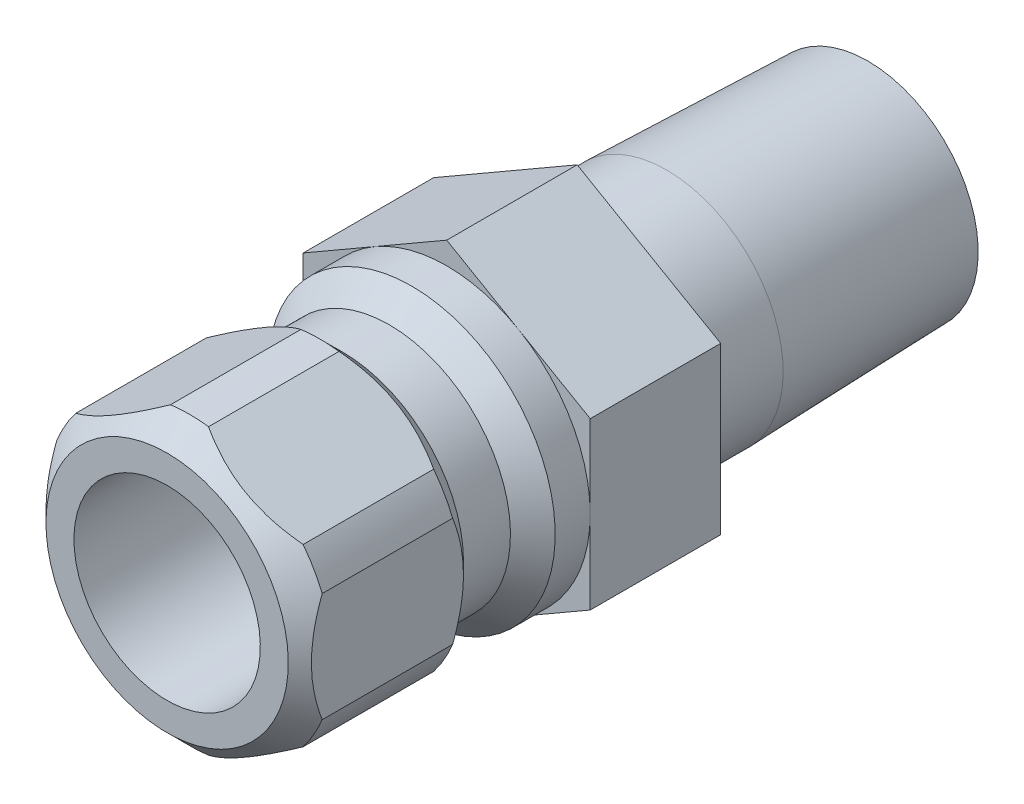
from build123d import *

# Parameters (mm, degrees)
SKETCH2_R           = 2.38125
BOSS_EXTRUDE1_DEPTH = 4.445
CUT_EXTRUDE1_START  = 3.556
SKETCH3_OUTSIDE_W   = 17.412
SKETCH3_OUTSIDE_H   = 18.924
CUT_EXTRUDE1_DEPTH  = 13.622216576


with BuildPart() as part:
    # Sketch1 → Revolve1 (revolve)
    with BuildSketch(Plane(origin=(0, 0, 0), x_dir=(0, 0, -1), z_dir=(1, 0, 0))):
        Polygon((-9.525, 3.175), (-9.525, 4.1275), (-8.763, 4.8895), (-4.318, 4.8895), (-3.556, 4.1275), (-1.9558, 4.1275), (-1.1938, 4.8895), (0, 4.8895), (0, 3.96875), (7.493, 3.96875), (14.351, 3.754438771), (14.351, 2.38125), (0.127, 2.38125), (0.127, 3.175), align=None)
    revolve(axis=Axis((0, 0, 0), (0, 0, 1)))

    # Sketch2 → Boss-Extrude1 (add)
    with BuildSketch(Plane.XY):
        Polygon((-4.8895, 2.822954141), (-4.8895, -2.822954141), (0, -5.645908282), (4.8895, -2.822954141), (4.8895, 2.822954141), (0, 5.645908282), align=None)
        with Locations(Location((0, 0, 0), (0, 0, 90))):
            Circle(SKETCH2_R, mode=Mode.SUBTRACT)
    extrude(amount=-BOSS_EXTRUDE1_DEPTH)

    # Sketch3 outside → Cut-Extrude1 (cut, through all)
    with BuildSketch(Plane.XY.offset(CUT_EXTRUDE1_START)):
        Rectangle(SKETCH3_OUTSIDE_W, SKETCH3_OUTSIDE_H)
        Polygon((-4.5212, 2.610316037), (-4.5212, -2.610316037), (0, -5.220632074), (4.5212, -2.610316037), (4.5212, 2.610316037), (0, 5.220632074), align=None, mode=Mode.SUBTRACT)
    extrude(amount=CUT_EXTRUDE1_DEPTH, mode=Mode.SUBTRACT)


solid = part.part
